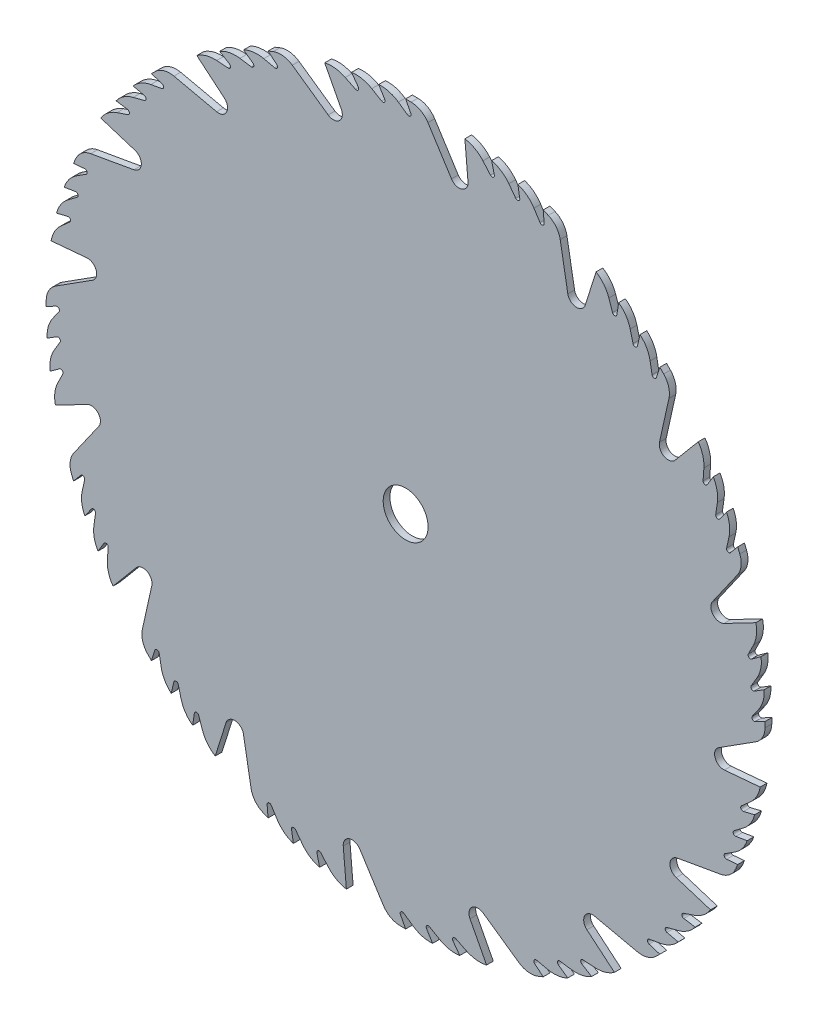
from build123d import *

# Parameters (mm, degrees)
SKETCH1_R         = 127
SKETCH1_R_2       = 7.9375
EXTRUDE1_DEPTH    = 2.38125
EXTRUDE2_DEPTH    = 180.620907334
CIRPATTERN1_COUNT = 16


with BuildPart() as part:
    # Sketch1 → Extrude1 (new body)
    with BuildSketch(Plane.XY):
        with Locations(Location((0, 0, 0), (0, 0, 180))):
            Circle(SKETCH1_R)
        with Locations(Location((0, 0, 0), (0, 0, 180))):
            Circle(SKETCH1_R_2, mode=Mode.SUBTRACT)
    extrude(amount=EXTRUDE1_DEPTH)

    # Sketch2 → Extrude2 (cut, through all)
    with BuildSketch(Plane.XY.offset(2.38125)):
        with BuildLine():
            ThreePointArc((-28.595300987, 123.738873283), (-37.795178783, 121.24571935), (-46.78215889, 118.069596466))
            ThreePointArc((-46.78215889, 118.069596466), (-43.310236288, 118.52428233), (-40.037885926, 117.278204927))
            Line((-40.037885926, 117.278204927), (-27.36845818, 108.406976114))
            ThreePointArc((-27.36845818, 108.406976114), (-23.453930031, 108.620692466), (-22.731093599, 112.473835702))
            Line((-22.731093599, 112.473835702), (-28.595300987, 123.738873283))
        make_face()
        with BuildLine():
            Line((-16.717610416, 122.27189106), (-19.115355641, 125.553188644))
            ThreePointArc((-19.115355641, 125.553188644), (-23.872570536, 124.73612298), (-28.595300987, 123.738873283))
            ThreePointArc((-28.595300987, 123.738873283), (-24.896319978, 123.943955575), (-21.344297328, 122.891503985))
            Line((-21.344297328, 122.891503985), (-17.710713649, 121.092261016))
            ThreePointArc((-17.710713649, 121.092261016), (-16.751272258, 121.292379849), (-16.717610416, 122.27189106))
        make_face()
        with BuildLine():
            Line((-7.383377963, 123.18839057), (-9.525, 126.642308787))
            ThreePointArc((-9.525, 126.642308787), (-14.3305282, 126.188890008), (-19.115355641, 125.553188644))
            ThreePointArc((-19.115355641, 125.553188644), (-15.411482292, 125.476759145), (-11.949646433, 124.157588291))
            Line((-11.949646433, 124.157588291), (-8.463200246, 122.08758863))
            ThreePointArc((-8.463200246, 122.08758863), (-7.491331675, 122.21426464), (-7.383377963, 123.18839057))
        make_face()
        with BuildLine():
            Line((1.832564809, 123.479675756), (0, 127))
            ThreePointArc((0, 127), (-4.765856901, 126.910545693), (-9.525, 126.642308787))
            ThreePointArc((-9.525, 126.642308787), (-5.881323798, 126.289916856), (-2.568356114, 124.732739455))
            Line((-2.568356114, 124.732739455), (0.673223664, 122.462960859))
            ThreePointArc((0.673223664, 122.462960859), (1.651855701, 122.516389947), (1.832564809, 123.479675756))
        make_face()
    extrude2 = extrude(amount=-EXTRUDE2_DEPTH, mode=Mode.SUBTRACT)

    # CirPattern1: Extrude2 ×16 about axis
    cirpattern1_axis = Axis((0, 0, 0), (0, 0, 1))
    for i in range(1, CIRPATTERN1_COUNT):
        add(extrude2.rotate(cirpattern1_axis, i * 360 / CIRPATTERN1_COUNT), mode=Mode.SUBTRACT)


solid = part.part
